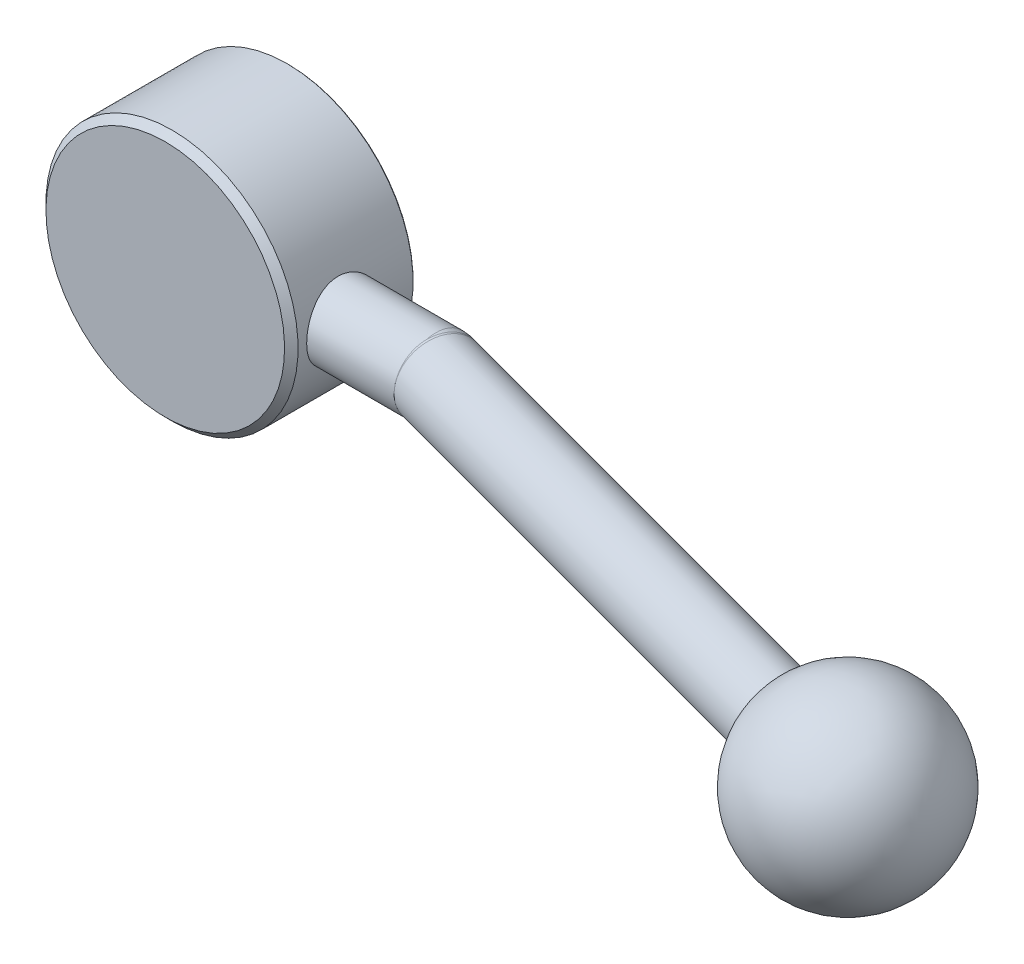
ISO-10303-21;
HEADER;
FILE_DESCRIPTION(('STEP AP214'),'2;1');
FILE_NAME('part.step','',(''),(''),'','','');
FILE_SCHEMA(('AUTOMOTIVE_DESIGN { 1 0 10303 214 1 1 1 1 }'));
ENDSEC;
DATA;
#1=APPLICATION_CONTEXT('core data for automotive mechanical design processes');
#2=APPLICATION_PROTOCOL_DEFINITION('international standard','automotive_design',2000,#1);
#3=PRODUCT_CONTEXT('',#1,'mechanical');
#4=PRODUCT('Part','Part','',(#3));
#5=PRODUCT_RELATED_PRODUCT_CATEGORY('part','',(#4));
#6=PRODUCT_DEFINITION_FORMATION('','',#4);
#7=PRODUCT_DEFINITION_CONTEXT('part definition',#1,'design');
#8=PRODUCT_DEFINITION('design','',#6,#7);
#9=PRODUCT_DEFINITION_SHAPE('','',#8);
#10=(LENGTH_UNIT() NAMED_UNIT(*) SI_UNIT(.MILLI.,.METRE.));
#11=(NAMED_UNIT(*) PLANE_ANGLE_UNIT() SI_UNIT($,.RADIAN.));
#12=(NAMED_UNIT(*) SI_UNIT($,.STERADIAN.) SOLID_ANGLE_UNIT());
#13=UNCERTAINTY_MEASURE_WITH_UNIT(LENGTH_MEASURE(1.E-05),#10,'distance_accuracy_value','');
#14=(GEOMETRIC_REPRESENTATION_CONTEXT(3) GLOBAL_UNCERTAINTY_ASSIGNED_CONTEXT((#13)) GLOBAL_UNIT_ASSIGNED_CONTEXT((#10,
#11,#12)) REPRESENTATION_CONTEXT('',''));
#15=CARTESIAN_POINT('',(0.,0.,0.));
#16=DIRECTION('',(0.,0.,1.));
#17=DIRECTION('',(1.,0.,0.));
#18=AXIS2_PLACEMENT_3D('',#15,#16,#17);
#19=CARTESIAN_POINT('',(0.,0.,0.));
#20=DIRECTION('',(0.,0.,-1.));
#21=DIRECTION('',(0.,1.,0.));
#22=AXIS2_PLACEMENT_3D('',#19,#20,#21);
#23=CYLINDRICAL_SURFACE('',#22,20.5);
#24=CARTESIAN_POINT('',(0.,0.,2.2));
#25=DIRECTION('',(0.,0.,-1.));
#26=DIRECTION('',(0.,1.,0.));
#27=AXIS2_PLACEMENT_3D('',#24,#25,#26);
#28=CIRCLE('',#27,20.5);
#29=CARTESIAN_POINT('',(0.,20.5,2.2));
#30=VERTEX_POINT('',#29);
#31=EDGE_CURVE('E97',#30,#30,#28,.T.);
#32=ORIENTED_EDGE('',*,*,#31,.F.);
#33=EDGE_LOOP('',(#32));
#34=FACE_BOUND('',#33,.T.);
#35=CARTESIAN_POINT('',(19.6022957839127,6.,13.5));
#36=CARTESIAN_POINT('',(19.602296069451,5.9999996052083,13.6645980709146));
#37=CARTESIAN_POINT('',(19.6043745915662,5.99322114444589,13.8292031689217));
#38=CARTESIAN_POINT('',(19.6126242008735,5.96616871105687,14.157201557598));
#39=CARTESIAN_POINT('',(19.618795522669,5.94589396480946,14.3205947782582));
#40=CARTESIAN_POINT('',(19.6350392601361,5.89203046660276,14.6449955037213));
#41=CARTESIAN_POINT('',(19.645112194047,5.85843994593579,14.8060026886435));
#42=CARTESIAN_POINT('',(19.6688547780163,5.77822628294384,15.124526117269));
#43=CARTESIAN_POINT('',(19.6825257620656,5.73159830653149,15.2820410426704));
#44=CARTESIAN_POINT('',(19.713022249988,5.62581323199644,15.592130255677));
#45=CARTESIAN_POINT('',(19.7298413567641,5.5666815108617,15.7447138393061));
#46=CARTESIAN_POINT('',(19.7661705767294,5.43627451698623,16.0443318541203));
#47=CARTESIAN_POINT('',(19.785681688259,5.36499473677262,16.1913642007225));
#48=CARTESIAN_POINT('',(19.8268343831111,5.2108537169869,16.4788588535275));
#49=CARTESIAN_POINT('',(19.8484753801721,5.12799566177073,16.6193229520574));
#50=CARTESIAN_POINT('',(19.8933081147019,4.95122279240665,16.8929236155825));
#51=CARTESIAN_POINT('',(19.9165004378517,4.85730379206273,17.0260573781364));
#52=CARTESIAN_POINT('',(19.9644466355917,4.65637414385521,17.2876250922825));
#53=CARTESIAN_POINT('',(19.9892257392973,4.54907914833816,17.4158360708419));
#54=CARTESIAN_POINT('',(20.039084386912,4.32416087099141,17.6628774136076));
#55=CARTESIAN_POINT('',(20.064164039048,4.20653376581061,17.7817042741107));
#56=CARTESIAN_POINT('',(20.1139266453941,3.9617603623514,18.0091415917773));
#57=CARTESIAN_POINT('',(20.1386096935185,3.83461635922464,18.117754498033));
#58=CARTESIAN_POINT('',(20.1869274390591,3.57153344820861,18.3241174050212));
#59=CARTESIAN_POINT('',(20.2105617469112,3.43559131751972,18.4218633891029));
#60=CARTESIAN_POINT('',(20.2565733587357,3.15310989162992,18.6075447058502));
#61=CARTESIAN_POINT('',(20.2789176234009,3.00641676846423,18.6952544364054));
#62=CARTESIAN_POINT('',(20.3212187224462,2.70575695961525,18.85799488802));
#63=CARTESIAN_POINT('',(20.3411746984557,2.5517876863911,18.9330210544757));
#64=CARTESIAN_POINT('',(20.3781129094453,2.23774430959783,19.0697232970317));
#65=CARTESIAN_POINT('',(20.3950961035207,2.07767219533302,19.1314036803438));
#66=CARTESIAN_POINT('',(20.42560313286,1.75253848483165,19.2409085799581));
#67=CARTESIAN_POINT('',(20.4391271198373,1.58747710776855,19.2887337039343));
#68=CARTESIAN_POINT('',(20.4620038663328,1.25813435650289,19.3689897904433));
#69=CARTESIAN_POINT('',(20.4714598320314,1.09395330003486,19.4018031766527));
#70=CARTESIAN_POINT('',(20.4864525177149,0.76330703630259,19.4535999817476));
#71=CARTESIAN_POINT('',(20.4919907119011,0.596842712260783,19.4725886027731));
#72=CARTESIAN_POINT('',(20.4989958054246,0.262822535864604,19.4965791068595));
#73=CARTESIAN_POINT('',(20.500462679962,0.095266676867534,19.5015809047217));
#74=CARTESIAN_POINT('',(20.4992830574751,-0.239660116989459,19.4975503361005));
#75=CARTESIAN_POINT('',(20.4966366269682,-0.407031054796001,19.4885181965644));
#76=CARTESIAN_POINT('',(20.4874491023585,-0.735222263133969,19.4569949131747));
#77=CARTESIAN_POINT('',(20.4810294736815,-0.896086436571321,19.4349234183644));
#78=CARTESIAN_POINT('',(20.4645655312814,-1.21537033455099,19.3778556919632));
#79=CARTESIAN_POINT('',(20.4545199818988,-1.37378920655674,19.3428550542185));
#80=CARTESIAN_POINT('',(20.4310714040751,-1.68699779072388,19.2602300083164));
#81=CARTESIAN_POINT('',(20.417669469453,-1.84178866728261,19.2126097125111));
#82=CARTESIAN_POINT('',(20.3878607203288,-2.14678325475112,19.1051327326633));
#83=CARTESIAN_POINT('',(20.3714527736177,-2.29698521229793,19.04527143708));
#84=CARTESIAN_POINT('',(20.3179422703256,-2.74243624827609,18.8465232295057));
#85=CARTESIAN_POINT('',(20.2768079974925,-3.02928804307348,18.6893299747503));
#86=CARTESIAN_POINT('',(20.1881245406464,-3.57292634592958,18.3311872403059));
#87=CARTESIAN_POINT('',(20.1405738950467,-3.8297059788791,18.1302277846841));
#88=CARTESIAN_POINT('',(20.0420851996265,-4.31608976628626,17.6814773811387));
#89=CARTESIAN_POINT('',(19.9910868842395,-4.5443478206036,17.432236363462));
#90=CARTESIAN_POINT('',(19.8929938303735,-4.95618403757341,16.8985135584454));
#91=CARTESIAN_POINT('',(19.8458994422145,-5.13975819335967,16.6140286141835));
#92=CARTESIAN_POINT('',(19.760667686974,-5.45834750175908,16.0144848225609));
#93=CARTESIAN_POINT('',(19.7226121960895,-5.59292425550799,15.6991805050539));
#94=CARTESIAN_POINT('',(19.6607470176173,-5.80668174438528,15.0490168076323));
#95=CARTESIAN_POINT('',(19.636932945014,-5.88587953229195,14.7141634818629));
#96=CARTESIAN_POINT('',(19.6072029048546,-5.98415852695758,14.0471839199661));
#97=CARTESIAN_POINT('',(19.6006798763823,-6.00527974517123,13.7153850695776));
#98=CARTESIAN_POINT('',(19.6045959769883,-5.9924844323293,13.052979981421));
#99=CARTESIAN_POINT('',(19.6150328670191,-5.95857516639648,12.7223735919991));
#100=CARTESIAN_POINT('',(19.6510985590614,-5.83849779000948,12.0800978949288));
#101=CARTESIAN_POINT('',(19.6763510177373,-5.75362308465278,11.7681634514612));
#102=CARTESIAN_POINT('',(19.7388196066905,-5.53550109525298,11.1629699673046));
#103=CARTESIAN_POINT('',(19.7760375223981,-5.40224659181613,10.8697137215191));
#104=CARTESIAN_POINT('',(19.859429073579,-5.08726254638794,10.3018842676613));
#105=CARTESIAN_POINT('',(19.9058087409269,-4.90437253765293,10.0279870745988));
#106=CARTESIAN_POINT('',(20.0018735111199,-4.49652620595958,9.51392317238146));
#107=CARTESIAN_POINT('',(20.0515593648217,-4.27156030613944,9.27376416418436));
#108=CARTESIAN_POINT('',(20.1254907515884,-3.90271430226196,8.93954124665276));
#109=CARTESIAN_POINT('',(20.1504641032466,-3.77196260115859,8.83082073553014));
#110=CARTESIAN_POINT('',(20.1992026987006,-3.5015777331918,8.62477718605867));
#111=CARTESIAN_POINT('',(20.2229683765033,-3.36194779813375,8.52745003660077));
#112=CARTESIAN_POINT('',(20.26863698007,-3.07465811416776,8.34485998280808));
#113=CARTESIAN_POINT('',(20.290539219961,-2.92699544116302,8.25960151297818));
#114=CARTESIAN_POINT('',(20.3318479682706,-2.62473033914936,8.10186753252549));
#115=CARTESIAN_POINT('',(20.351255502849,-2.47013079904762,8.0293867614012));
#116=CARTESIAN_POINT('',(20.3869012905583,-2.15616171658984,7.89824135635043));
#117=CARTESIAN_POINT('',(20.4031616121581,-1.99683515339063,7.839479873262));
#118=CARTESIAN_POINT('',(20.4322188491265,-1.67354665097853,7.73562199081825));
#119=CARTESIAN_POINT('',(20.4450171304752,-1.50958656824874,7.69052020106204));
#120=CARTESIAN_POINT('',(20.4667887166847,-1.17818990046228,7.61435869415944));
#121=CARTESIAN_POINT('',(20.4757621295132,-1.01075341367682,7.58329858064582));
#122=CARTESIAN_POINT('',(20.4896217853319,-0.67368142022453,7.53551127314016));
#123=CARTESIAN_POINT('',(20.4945081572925,-0.504045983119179,7.51878362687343));
#124=CARTESIAN_POINT('',(20.4999481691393,-0.170186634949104,7.50017093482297));
#125=CARTESIAN_POINT('',(20.5006551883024,-0.00599429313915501,7.49776044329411));
#126=CARTESIAN_POINT('',(20.4981265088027,0.322062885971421,7.50640275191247));
#127=CARTESIAN_POINT('',(20.4948894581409,0.485927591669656,7.5174601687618));
#128=CARTESIAN_POINT('',(20.4845610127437,0.812008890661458,7.55293963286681));
#129=CARTESIAN_POINT('',(20.4774712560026,0.974226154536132,7.57735600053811));
#130=CARTESIAN_POINT('',(20.4596287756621,1.29598110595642,7.63934399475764));
#131=CARTESIAN_POINT('',(20.4488746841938,1.45551776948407,7.67692053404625));
#132=CARTESIAN_POINT('',(20.424118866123,1.76913741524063,7.76446354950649));
#133=CARTESIAN_POINT('',(20.4101513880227,1.92325942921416,7.81429972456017));
#134=CARTESIAN_POINT('',(20.3792774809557,2.2267396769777,7.92614844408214));
#135=CARTESIAN_POINT('',(20.3623699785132,2.37609614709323,7.98816543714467));
#136=CARTESIAN_POINT('',(20.307879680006,2.81545866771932,8.19177825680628));
#137=CARTESIAN_POINT('',(20.2665061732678,3.09703370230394,8.3510134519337));
#138=CARTESIAN_POINT('',(20.1764364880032,3.63857835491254,8.71764071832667));
#139=CARTESIAN_POINT('',(20.127553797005,3.89761359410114,8.92636675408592));
#140=CARTESIAN_POINT('',(20.0533973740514,4.25750563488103,9.26901897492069));
#141=CARTESIAN_POINT('',(20.0285233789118,4.37275848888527,9.38825080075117));
#142=CARTESIAN_POINT('',(19.9791591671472,4.59302855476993,9.63586914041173));
#143=CARTESIAN_POINT('',(19.9546688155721,4.69804943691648,9.76425234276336));
#144=CARTESIAN_POINT('',(19.9060543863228,4.90001052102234,10.0331600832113));
#145=CARTESIAN_POINT('',(19.8819604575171,4.99663657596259,10.1739258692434));
#146=CARTESIAN_POINT('',(19.835595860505,5.17763097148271,10.4633483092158));
#147=CARTESIAN_POINT('',(19.8133245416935,5.2620036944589,10.6120021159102));
#148=CARTESIAN_POINT('',(19.771273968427,5.41786338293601,10.9162121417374));
#149=CARTESIAN_POINT('',(19.7514941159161,5.48935344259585,11.0717666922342));
#150=CARTESIAN_POINT('',(19.7150383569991,5.61887839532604,11.3887195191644));
#151=CARTESIAN_POINT('',(19.6983620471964,5.67691503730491,11.5501170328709));
#152=CARTESIAN_POINT('',(19.6704409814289,5.77286183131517,11.8578031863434));
#153=CARTESIAN_POINT('',(19.6587834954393,5.81235613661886,12.003562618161));
#154=CARTESIAN_POINT('',(19.6385752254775,5.88027391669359,12.2978447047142));
#155=CARTESIAN_POINT('',(19.6300241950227,5.90869826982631,12.4463671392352));
#156=CARTESIAN_POINT('',(19.6162509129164,5.95426469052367,12.7452883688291));
#157=CARTESIAN_POINT('',(19.6110286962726,5.97140663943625,12.8956871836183));
#158=CARTESIAN_POINT('',(19.6040514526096,5.99427298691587,13.1973888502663));
#159=CARTESIAN_POINT('',(19.6022955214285,6.00000036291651,13.3486914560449));
#160=CARTESIAN_POINT('',(19.6022957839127,6.,13.5));
#161=B_SPLINE_CURVE_WITH_KNOTS('',3,(#35,#36,#37,#38,#39,#40,#41,#42,#43,#44,#45,#46,#47,#48,
#49,#50,#51,#52,#53,#54,#55,#56,#57,#58,#59,#60,#61,#62,#63,#64,#65,#66,#67,#68,#69,#70,#71,#72,
#73,#74,#75,#76,#77,#78,#79,#80,#81,#82,#83,#84,#85,#86,#87,#88,#89,#90,#91,#92,#93,#94,#95,#96,
#97,#98,#99,#100,#101,#102,#103,#104,#105,#106,#107,#108,#109,#110,#111,#112,#113,#114,#115,
#116,#117,#118,#119,#120,#121,#122,#123,#124,#125,#126,#127,#128,#129,#130,#131,#132,#133,#134,
#135,#136,#137,#138,#139,#140,#141,#142,#143,#144,#145,#146,#147,#148,#149,#150,#151,#152,#153,
#154,#155,#156,#157,#158,#159,#160),.UNSPECIFIED.,.T.,.F.,(4,2,2,2,2,2,2,2,2,2,2,2,2,2,2,2,2,2,
2,2,2,2,2,2,2,2,2,2,2,2,2,2,2,2,2,2,2,2,2,2,2,2,2,2,2,2,2,2,2,2,2,2,2,2,2,2,2,2,2,2,2,2,4),(0.,
0.493654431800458,0.987337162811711,1.48108549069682,1.97501713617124,2.46795578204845,
2.96107772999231,3.45406432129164,3.9472380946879,4.45368702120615,4.96032415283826,
5.46683949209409,5.97354143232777,6.49001701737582,7.00667767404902,7.52317133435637,
8.03964233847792,8.5421022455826,9.04437298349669,9.54664678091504,10.0489124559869,
10.5358322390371,11.0229181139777,11.5098454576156,11.9969565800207,12.9811480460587,
13.9655640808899,14.9861703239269,16.0068680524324,17.0364860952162,18.06578694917,
19.058440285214,20.0509625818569,21.019302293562,21.9877865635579,22.9812230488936,
23.9748859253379,24.4899930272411,25.0049136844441,25.5200230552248,26.0349198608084,
26.5460638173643,27.0570058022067,27.5679333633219,28.0788448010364,28.5708836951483,
29.0630913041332,29.5550898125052,30.0472721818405,30.5344337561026,31.021773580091,
31.995601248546,32.9994682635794,33.5020562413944,34.004463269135,34.5211368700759,
35.0376252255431,35.5539893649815,36.0702863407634,36.5242331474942,36.9781439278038,
37.4320594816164,37.8858566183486),.UNSPECIFIED.);
#162=CARTESIAN_POINT('',(19.6022957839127,6.,13.5));
#163=VERTEX_POINT('',#162);
#164=EDGE_CURVE('E22',#163,#163,#161,.T.);
#165=ORIENTED_EDGE('',*,*,#164,.F.);
#166=EDGE_LOOP('',(#165));
#167=FACE_BOUND('',#166,.T.);
#168=CARTESIAN_POINT('',(0.,0.,20.9));
#169=DIRECTION('',(0.,0.,-1.));
#170=DIRECTION('',(0.,1.,0.));
#171=AXIS2_PLACEMENT_3D('',#168,#169,#170);
#172=CIRCLE('',#171,20.5);
#173=CARTESIAN_POINT('',(0.,20.5,20.9));
#174=VERTEX_POINT('',#173);
#175=EDGE_CURVE('E94',#174,#174,#172,.T.);
#176=ORIENTED_EDGE('',*,*,#175,.T.);
#177=EDGE_LOOP('',(#176));
#178=FACE_BOUND('',#177,.T.);
#179=ADVANCED_FACE('F14',(#34,#167,#178),#23,.T.);
#180=CARTESIAN_POINT('',(0.,0.,22.));
#181=DIRECTION('',(0.,0.,-1.));
#182=DIRECTION('',(0.,1.,0.));
#183=AXIS2_PLACEMENT_3D('',#180,#181,#182);
#184=PLANE('',#183);
#185=CARTESIAN_POINT('',(0.,0.,22.));
#186=DIRECTION('',(0.,0.,-1.));
#187=DIRECTION('',(0.,1.,0.));
#188=AXIS2_PLACEMENT_3D('',#185,#186,#187);
#189=CIRCLE('',#188,19.4);
#190=CARTESIAN_POINT('',(0.,19.4,22.));
#191=VERTEX_POINT('',#190);
#192=EDGE_CURVE('E91',#191,#191,#189,.T.);
#193=ORIENTED_EDGE('',*,*,#192,.F.);
#194=EDGE_LOOP('',(#193));
#195=FACE_BOUND('',#194,.T.);
#196=ADVANCED_FACE('F16',(#195),#184,.F.);
#197=CARTESIAN_POINT('',(0.,0.,22.));
#198=DIRECTION('',(0.,0.,-1.));
#199=DIRECTION('',(0.,1.,0.));
#200=AXIS2_PLACEMENT_3D('',#197,#198,#199);
#201=CONICAL_SURFACE('',#200,19.4,0.785398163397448);
#202=ORIENTED_EDGE('',*,*,#175,.F.);
#203=EDGE_LOOP('',(#202));
#204=FACE_BOUND('',#203,.T.);
#205=ORIENTED_EDGE('',*,*,#192,.T.);
#206=EDGE_LOOP('',(#205));
#207=FACE_BOUND('',#206,.T.);
#208=ADVANCED_FACE('F78',(#204,#207),#201,.T.);
#209=CARTESIAN_POINT('',(0.,0.,2.2));
#210=DIRECTION('',(0.,0.,1.));
#211=DIRECTION('',(0.,-1.,0.));
#212=AXIS2_PLACEMENT_3D('',#209,#210,#211);
#213=CONICAL_SURFACE('',#212,20.5,0.785398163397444);
#214=CARTESIAN_POINT('',(0.,0.,2.));
#215=DIRECTION('',(0.,0.,-1.));
#216=DIRECTION('',(0.,1.,0.));
#217=AXIS2_PLACEMENT_3D('',#214,#215,#216);
#218=CIRCLE('',#217,20.3);
#219=CARTESIAN_POINT('',(0.,20.3,2.));
#220=VERTEX_POINT('',#219);
#221=EDGE_CURVE('E100',#220,#220,#218,.T.);
#222=ORIENTED_EDGE('',*,*,#221,.F.);
#223=EDGE_LOOP('',(#222));
#224=FACE_BOUND('',#223,.T.);
#225=ORIENTED_EDGE('',*,*,#31,.T.);
#226=EDGE_LOOP('',(#225));
#227=FACE_BOUND('',#226,.T.);
#228=ADVANCED_FACE('F84',(#224,#227),#213,.T.);
#229=CARTESIAN_POINT('',(20.3,0.,2.));
#230=DIRECTION('',(0.,0.,1.));
#231=DIRECTION('',(0.,-1.,0.));
#232=AXIS2_PLACEMENT_3D('',#229,#230,#231);
#233=PLANE('',#232);
#234=CARTESIAN_POINT('',(0.,0.,2.));
#235=DIRECTION('',(0.,0.,-1.));
#236=DIRECTION('',(0.,1.,0.));
#237=AXIS2_PLACEMENT_3D('',#234,#235,#236);
#238=CIRCLE('',#237,9.5);
#239=CARTESIAN_POINT('',(0.,9.5,2.));
#240=VERTEX_POINT('',#239);
#241=EDGE_CURVE('E103',#240,#240,#238,.T.);
#242=ORIENTED_EDGE('',*,*,#241,.F.);
#243=EDGE_LOOP('',(#242));
#244=FACE_BOUND('',#243,.T.);
#245=ORIENTED_EDGE('',*,*,#221,.T.);
#246=EDGE_LOOP('',(#245));
#247=FACE_BOUND('',#246,.T.);
#248=ADVANCED_FACE('F112',(#244,#247),#233,.F.);
#249=CARTESIAN_POINT('',(0.,0.,0.));
#250=DIRECTION('',(0.,0.,-1.));
#251=DIRECTION('',(0.,1.,0.));
#252=AXIS2_PLACEMENT_3D('',#249,#250,#251);
#253=CYLINDRICAL_SURFACE('',#252,9.5);
#254=CARTESIAN_POINT('',(0.,0.,0.));
#255=DIRECTION('',(0.,0.,-1.));
#256=DIRECTION('',(0.,1.,0.));
#257=AXIS2_PLACEMENT_3D('',#254,#255,#256);
#258=CIRCLE('',#257,9.5);
#259=CARTESIAN_POINT('',(0.,9.5,0.));
#260=VERTEX_POINT('',#259);
#261=EDGE_CURVE('E38',#260,#260,#258,.T.);
#262=ORIENTED_EDGE('',*,*,#261,.F.);
#263=EDGE_LOOP('',(#262));
#264=FACE_BOUND('',#263,.T.);
#265=ORIENTED_EDGE('',*,*,#241,.T.);
#266=EDGE_LOOP('',(#265));
#267=FACE_BOUND('',#266,.T.);
#268=ADVANCED_FACE('F109',(#264,#267),#253,.T.);
#269=CARTESIAN_POINT('',(9.5,0.,0.));
#270=DIRECTION('',(0.,0.,1.));
#271=DIRECTION('',(0.,-1.,0.));
#272=AXIS2_PLACEMENT_3D('',#269,#270,#271);
#273=PLANE('',#272);
#274=CARTESIAN_POINT('',(0.,0.,0.));
#275=DIRECTION('',(0.,0.,-1.));
#276=DIRECTION('',(0.,1.,0.));
#277=AXIS2_PLACEMENT_3D('',#274,#275,#276);
#278=CIRCLE('',#277,5.);
#279=CARTESIAN_POINT('',(0.,5.,0.));
#280=VERTEX_POINT('',#279);
#281=EDGE_CURVE('E240',#280,#280,#278,.T.);
#282=ORIENTED_EDGE('',*,*,#281,.F.);
#283=EDGE_LOOP('',(#282));
#284=FACE_BOUND('',#283,.T.);
#285=ORIENTED_EDGE('',*,*,#261,.T.);
#286=EDGE_LOOP('',(#285));
#287=FACE_BOUND('',#286,.T.);
#288=ADVANCED_FACE('F71',(#284,#287),#273,.F.);
#289=CARTESIAN_POINT('',(41.5,0.,13.5));
#290=DIRECTION('',(1.,0.,0.));
#291=DIRECTION('',(0.,1.,0.));
#292=AXIS2_PLACEMENT_3D('',#289,#290,#291);
#293=CYLINDRICAL_SURFACE('',#292,6.);
#294=CARTESIAN_POINT('',(35.5002,-5.80289630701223,15.0252522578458));
#295=CARTESIAN_POINT('',(35.4582822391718,-5.76163633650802,15.1823953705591));
#296=CARTESIAN_POINT('',(35.4196657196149,-5.7137075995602,15.3386228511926));
#297=CARTESIAN_POINT('',(35.3477160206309,-5.6048321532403,15.6476859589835));
#298=CARTESIAN_POINT('',(35.3143816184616,-5.54388846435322,15.8005223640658));
#299=CARTESIAN_POINT('',(35.2516846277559,-5.40933866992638,16.1011931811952));
#300=CARTESIAN_POINT('',(35.2223187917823,-5.33574303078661,16.249031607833));
#301=CARTESIAN_POINT('',(35.1669003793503,-5.17630824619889,16.5386084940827));
#302=CARTESIAN_POINT('',(35.1408479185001,-5.09046867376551,16.6803467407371));
#303=CARTESIAN_POINT('',(35.0916157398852,-4.90713469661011,16.9565144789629));
#304=CARTESIAN_POINT('',(35.0684348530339,-4.80964506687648,17.0909469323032));
#305=CARTESIAN_POINT('',(35.0246338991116,-4.60359121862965,17.3515649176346));
#306=CARTESIAN_POINT('',(35.0040147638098,-4.49502299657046,17.4777474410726));
#307=CARTESIAN_POINT('',(34.9651498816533,-4.26763611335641,17.7207771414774));
#308=CARTESIAN_POINT('',(34.9469028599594,-4.14882301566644,17.8376293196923));
#309=CARTESIAN_POINT('',(34.9126153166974,-3.90166417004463,18.0612276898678));
#310=CARTESIAN_POINT('',(34.8965756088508,-3.77331493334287,18.1679701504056));
#311=CARTESIAN_POINT('',(34.8665183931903,-3.50726425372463,18.3710637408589));
#312=CARTESIAN_POINT('',(34.8525127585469,-3.36951429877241,18.4673530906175));
#313=CARTESIAN_POINT('',(34.8265462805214,-3.08623101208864,18.6481475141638));
#314=CARTESIAN_POINT('',(34.8145862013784,-2.94069479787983,18.7326481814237));
#315=CARTESIAN_POINT('',(34.7926597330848,-2.64294989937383,18.8891648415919));
#316=CARTESIAN_POINT('',(34.7826929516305,-2.49074253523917,18.9611832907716));
#317=CARTESIAN_POINT('',(34.7647029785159,-2.18065815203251,19.092233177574));
#318=CARTESIAN_POINT('',(34.7566805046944,-2.02277906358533,19.1512598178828));
#319=CARTESIAN_POINT('',(34.7425870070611,-1.70332850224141,19.2555856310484));
#320=CARTESIAN_POINT('',(34.7365065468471,-1.54177910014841,19.3009511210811));
#321=CARTESIAN_POINT('',(34.7262194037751,-1.21533071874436,19.378019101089));
#322=CARTESIAN_POINT('',(34.7220134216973,-1.05043051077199,19.4097164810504));
#323=CARTESIAN_POINT('',(34.7154660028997,-0.71860500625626,19.4591719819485));
#324=CARTESIAN_POINT('',(34.7131235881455,-0.551680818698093,19.4769374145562));
#325=CARTESIAN_POINT('',(34.710291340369,-0.216839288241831,19.4984280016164));
#326=CARTESIAN_POINT('',(34.7098023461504,-0.0489215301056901,19.5021467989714));
#327=CARTESIAN_POINT('',(34.7106764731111,0.286163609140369,19.4955078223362));
#328=CARTESIAN_POINT('',(34.7120344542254,0.453331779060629,19.4851891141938));
#329=CARTESIAN_POINT('',(34.7165967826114,0.78612042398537,19.4506291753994));
#330=CARTESIAN_POINT('',(34.7198002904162,0.951741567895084,19.4263942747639));
#331=CARTESIAN_POINT('',(34.7280656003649,1.28041642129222,19.3641727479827));
#332=CARTESIAN_POINT('',(34.7331283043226,1.44346884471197,19.3261794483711));
#333=CARTESIAN_POINT('',(34.7451271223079,1.76570625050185,19.2367438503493));
#334=CARTESIAN_POINT('',(34.7520625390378,1.92489264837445,19.1853065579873));
#335=CARTESIAN_POINT('',(34.7678369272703,2.23840371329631,19.0693353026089));
#336=CARTESIAN_POINT('',(34.7766767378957,2.39272620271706,19.0047955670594));
#337=CARTESIAN_POINT('',(34.7962906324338,2.69529094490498,18.863142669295));
#338=CARTESIAN_POINT('',(34.8070640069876,2.84353540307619,18.7860341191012));
#339=CARTESIAN_POINT('',(34.8305995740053,3.13300119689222,18.6197820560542));
#340=CARTESIAN_POINT('',(34.8433622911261,3.27422066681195,18.5306353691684));
#341=CARTESIAN_POINT('',(34.8709361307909,3.54855763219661,18.3410259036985));
#342=CARTESIAN_POINT('',(34.8857465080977,3.68167805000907,18.2405672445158));
#343=CARTESIAN_POINT('',(34.9175622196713,3.93937834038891,18.0287099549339));
#344=CARTESIAN_POINT('',(34.9345746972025,4.06392830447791,17.9172760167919));
#345=CARTESIAN_POINT('',(34.9708735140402,4.30309404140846,17.6846387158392));
#346=CARTESIAN_POINT('',(34.990159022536,4.41771341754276,17.5634389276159));
#347=CARTESIAN_POINT('',(35.0311875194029,4.6363260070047,17.3121162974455));
#348=CARTESIAN_POINT('',(35.0529314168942,4.74031526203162,17.1819901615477));
#349=CARTESIAN_POINT('',(35.0991047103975,4.93688268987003,16.9139128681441));
#350=CARTESIAN_POINT('',(35.1235330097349,5.02946549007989,16.775964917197));
#351=CARTESIAN_POINT('',(35.1725720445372,5.19312021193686,16.5088639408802));
#352=CARTESIAN_POINT('',(35.1968667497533,5.26543815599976,16.3804141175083));
#353=CARTESIAN_POINT('',(35.2482373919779,5.40022788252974,16.1190011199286));
#354=CARTESIAN_POINT('',(35.2753129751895,5.46270091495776,15.9860385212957));
#355=CARTESIAN_POINT('',(35.3327563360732,5.57750379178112,15.7165012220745));
#356=CARTESIAN_POINT('',(35.3631238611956,5.62983441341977,15.5799267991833));
#357=CARTESIAN_POINT('',(35.4281734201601,5.72416883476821,15.3042217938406));
#358=CARTESIAN_POINT('',(35.4628566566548,5.76616974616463,15.1650905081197));
#359=CARTESIAN_POINT('',(35.5001999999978,5.80289630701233,15.0252522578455));
#360=B_SPLINE_CURVE_WITH_KNOTS('',3,(#294,#295,#296,#297,#298,#299,#300,#301,#302,#303,#304,
#305,#306,#307,#308,#309,#310,#311,#312,#313,#314,#315,#316,#317,#318,#319,#320,#321,#322,#323,
#324,#325,#326,#327,#328,#329,#330,#331,#332,#333,#334,#335,#336,#337,#338,#339,#340,#341,#342,
#343,#344,#345,#346,#347,#348,#349,#350,#351,#352,#353,#354,#355,#356,#357,#358,#359),
.UNSPECIFIED.,.F.,.F.,(4,2,2,2,2,2,2,2,2,2,2,2,2,2,2,2,2,2,2,2,2,2,2,2,2,2,2,2,2,2,2,2,4),(0.,
0.503145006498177,1.00617337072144,1.50878758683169,2.01141933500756,2.51384577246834,
3.01645442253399,3.5187918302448,4.0213139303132,4.52666061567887,5.03219569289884,
5.53763117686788,6.04325298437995,6.5463791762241,7.04969330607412,7.55274311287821,
8.05602055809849,8.55790026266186,9.05955185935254,9.56144710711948,10.0631557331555,
10.5650858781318,11.0668322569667,11.5687111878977,12.0704079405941,12.5737749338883,
13.0769585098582,13.580328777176,14.0834941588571,14.5312769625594,14.9790028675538,
15.4266944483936,15.8745110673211),.UNSPECIFIED.);
#361=CARTESIAN_POINT('',(35.5,-5.80270009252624,15.0259985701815));
#362=VERTEX_POINT('',#361);
#363=CARTESIAN_POINT('',(34.7100850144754,0.,19.5));
#364=VERTEX_POINT('',#363);
#365=EDGE_CURVE('E29',#362,#364,#360,.T.);
#366=ORIENTED_EDGE('',*,*,#365,.T.);
#367=CARTESIAN_POINT('',(35.5,5.80270009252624,15.0259985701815));
#368=VERTEX_POINT('',#367);
#369=EDGE_CURVE('E40',#364,#368,#360,.T.);
#370=ORIENTED_EDGE('',*,*,#369,.T.);
#371=CARTESIAN_POINT('',(35.5,0.,13.5));
#372=DIRECTION('',(1.,0.,0.));
#373=DIRECTION('',(0.,1.,0.));
#374=AXIS2_PLACEMENT_3D('',#371,#372,#373);
#375=CIRCLE('',#374,6.);
#376=EDGE_CURVE('E36',#362,#368,#375,.T.);
#377=ORIENTED_EDGE('',*,*,#376,.F.);
#378=EDGE_LOOP('',(#366,#370,#377));
#379=FACE_BOUND('',#378,.T.);
#380=ORIENTED_EDGE('',*,*,#164,.T.);
#381=EDGE_LOOP('',(#380));
#382=FACE_BOUND('',#381,.T.);
#383=ADVANCED_FACE('F41',(#379,#382),#293,.T.);
#384=CARTESIAN_POINT('',(35.5,0.,13.5));
#385=DIRECTION('',(1.,0.,0.));
#386=DIRECTION('',(0.,0.,-1.));
#387=AXIS2_PLACEMENT_3D('',#384,#385,#386);
#388=SPHERICAL_SURFACE('',#387,6.);
#389=CARTESIAN_POINT('',(35.8814996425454,0.,13.6022225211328));
#390=DIRECTION('',(0.965925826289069,0.,0.258819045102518));
#391=DIRECTION('',(-0.258819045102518,0.,0.965925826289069));
#392=AXIS2_PLACEMENT_3D('',#389,#390,#391);
#393=CIRCLE('',#392,5.98698660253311);
#394=EDGE_CURVE('E9',#362,#368,#393,.T.);
#395=ORIENTED_EDGE('',*,*,#394,.F.);
#396=ORIENTED_EDGE('',*,*,#376,.T.);
#397=EDGE_LOOP('',(#395,#396));
#398=FACE_BOUND('',#397,.T.);
#399=ADVANCED_FACE('F37',(#398),#388,.T.);
#400=CARTESIAN_POINT('',(36.2629992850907,0.,13.7044450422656));
#401=DIRECTION('',(0.965925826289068,0.,0.258819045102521));
#402=DIRECTION('',(-0.258819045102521,0.,0.965925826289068));
#403=AXIS2_PLACEMENT_3D('',#400,#401,#402);
#404=SPHERICAL_SURFACE('',#403,6.);
#405=ORIENTED_EDGE('',*,*,#365,.F.);
#406=ORIENTED_EDGE('',*,*,#394,.T.);
#407=ORIENTED_EDGE('',*,*,#369,.F.);
#408=CARTESIAN_POINT('',(36.2629992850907,0.,13.7044450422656));
#409=DIRECTION('',(0.965925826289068,0.,0.258819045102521));
#410=DIRECTION('',(-0.258819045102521,0.,0.965925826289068));
#411=AXIS2_PLACEMENT_3D('',#408,#409,#410);
#412=CIRCLE('',#411,6.);
#413=EDGE_CURVE('E45',#364,#364,#412,.T.);
#414=ORIENTED_EDGE('',*,*,#413,.F.);
#415=EDGE_LOOP('',(#405,#406,#407,#414));
#416=FACE_BOUND('',#415,.T.);
#417=ADVANCED_FACE('F47',(#416),#404,.T.);
#418=CARTESIAN_POINT('',(141.483133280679,0.,41.8980949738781));
#419=DIRECTION('',(0.965925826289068,0.,0.258819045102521));
#420=DIRECTION('',(-0.258819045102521,0.,0.965925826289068));
#421=AXIS2_PLACEMENT_3D('',#418,#419,#420);
#422=CYLINDRICAL_SURFACE('',#421,6.);
#423=CARTESIAN_POINT('',(114.851814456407,0.,34.7622546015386));
#424=DIRECTION('',(0.965925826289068,0.,0.258819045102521));
#425=DIRECTION('',(-0.258819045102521,0.,0.965925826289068));
#426=AXIS2_PLACEMENT_3D('',#423,#424,#425);
#427=CIRCLE('',#426,6.);
#428=CARTESIAN_POINT('',(116.404728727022,0.,28.9666996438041));
#429=VERTEX_POINT('',#428);
#430=EDGE_CURVE('E243',#429,#429,#427,.T.);
#431=ORIENTED_EDGE('',*,*,#430,.F.);
#432=EDGE_LOOP('',(#431));
#433=FACE_BOUND('',#432,.T.);
#434=ORIENTED_EDGE('',*,*,#413,.T.);
#435=EDGE_LOOP('',(#434));
#436=FACE_BOUND('',#435,.T.);
#437=ADVANCED_FACE('F64',(#433,#436),#422,.T.);
#438=CARTESIAN_POINT('',(114.851814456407,0.,34.7622546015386));
#439=DIRECTION('',(-0.965925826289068,0.,-0.258819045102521));
#440=DIRECTION('',(0.258819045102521,0.,-0.965925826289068));
#441=AXIS2_PLACEMENT_3D('',#438,#439,#440);
#442=CONICAL_SURFACE('',#441,6.,1.48352986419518);
#443=CARTESIAN_POINT('',(114.68956979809,0.,34.7187812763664));
#444=DIRECTION('',(0.965925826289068,0.,0.258819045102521));
#445=DIRECTION('',(-0.258819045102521,0.,0.965925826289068));
#446=AXIS2_PLACEMENT_3D('',#443,#444,#445);
#447=CIRCLE('',#446,7.91988336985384);
#448=CARTESIAN_POINT('',(116.739386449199,0.,27.0687613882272));
#449=VERTEX_POINT('',#448);
#450=EDGE_CURVE('E239',#449,#449,#447,.T.);
#451=CARTESIAN_POINT('',(116.739386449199,0.,27.0687613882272));
#452=CARTESIAN_POINT('',(116.73590043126,0.,27.0885315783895));
#453=CARTESIAN_POINT('',(116.732414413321,0.,27.1083017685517));
#454=CARTESIAN_POINT('',(116.725442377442,0.,27.1478421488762));
#455=CARTESIAN_POINT('',(116.721956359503,0.,27.1676123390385));
#456=CARTESIAN_POINT('',(116.714984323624,0.,27.207152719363));
#457=CARTESIAN_POINT('',(116.711498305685,0.,27.2269229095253));
#458=CARTESIAN_POINT('',(116.704526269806,0.,27.2664632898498));
#459=CARTESIAN_POINT('',(116.701040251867,0.,27.286233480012));
#460=CARTESIAN_POINT('',(116.694068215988,0.,27.3257738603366));
#461=CARTESIAN_POINT('',(116.690582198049,0.,27.3455440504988));
#462=CARTESIAN_POINT('',(116.68361016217,0.,27.3850844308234));
#463=CARTESIAN_POINT('',(116.68012414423,0.,27.4048546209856));
#464=CARTESIAN_POINT('',(116.673152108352,0.,27.4443950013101));
#465=CARTESIAN_POINT('',(116.669666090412,0.,27.4641651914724));
#466=CARTESIAN_POINT('',(116.662694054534,0.,27.5037055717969));
#467=CARTESIAN_POINT('',(116.659208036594,0.,27.5234757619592));
#468=CARTESIAN_POINT('',(116.652236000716,0.,27.5630161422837));
#469=CARTESIAN_POINT('',(116.648749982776,0.,27.5827863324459));
#470=CARTESIAN_POINT('',(116.641777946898,0.,27.6223267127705));
#471=CARTESIAN_POINT('',(116.638291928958,0.,27.6420969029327));
#472=CARTESIAN_POINT('',(116.63131989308,0.,27.6816372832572));
#473=CARTESIAN_POINT('',(116.62783387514,0.,27.7014074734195));
#474=CARTESIAN_POINT('',(116.620861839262,0.,27.740947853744));
#475=CARTESIAN_POINT('',(116.617375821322,0.,27.7607180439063));
#476=CARTESIAN_POINT('',(116.610403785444,0.,27.8002584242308));
#477=CARTESIAN_POINT('',(116.606917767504,0.,27.8200286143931));
#478=CARTESIAN_POINT('',(116.599945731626,0.,27.8595689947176));
#479=CARTESIAN_POINT('',(116.596459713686,0.,27.8793391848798));
#480=CARTESIAN_POINT('',(116.589487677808,0.,27.9188795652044));
#481=CARTESIAN_POINT('',(116.586001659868,0.,27.9386497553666));
#482=CARTESIAN_POINT('',(116.57902962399,0.,27.9781901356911));
#483=CARTESIAN_POINT('',(116.57554360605,0.,27.9979603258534));
#484=CARTESIAN_POINT('',(116.568571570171,0.,28.0375007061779));
#485=CARTESIAN_POINT('',(116.565085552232,0.,28.0572708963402));
#486=CARTESIAN_POINT('',(116.558113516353,0.,28.0968112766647));
#487=CARTESIAN_POINT('',(116.554627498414,0.,28.116581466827));
#488=CARTESIAN_POINT('',(116.547655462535,0.,28.1561218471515));
#489=CARTESIAN_POINT('',(116.544169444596,0.,28.1758920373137));
#490=CARTESIAN_POINT('',(116.537197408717,0.,28.2154324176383));
#491=CARTESIAN_POINT('',(116.533711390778,0.,28.2352026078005));
#492=CARTESIAN_POINT('',(116.526739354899,0.,28.274742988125));
#493=CARTESIAN_POINT('',(116.52325333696,0.,28.2945131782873));
#494=CARTESIAN_POINT('',(116.516281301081,0.,28.3340535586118));
#495=CARTESIAN_POINT('',(116.512795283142,0.,28.3538237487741));
#496=CARTESIAN_POINT('',(116.505823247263,0.,28.3933641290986));
#497=CARTESIAN_POINT('',(116.502337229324,0.,28.4131343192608));
#498=CARTESIAN_POINT('',(116.495365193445,0.,28.4526746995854));
#499=CARTESIAN_POINT('',(116.491879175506,0.,28.4724448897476));
#500=CARTESIAN_POINT('',(116.484907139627,0.,28.5119852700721));
#501=CARTESIAN_POINT('',(116.481421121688,0.,28.5317554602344));
#502=CARTESIAN_POINT('',(116.474449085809,0.,28.5712958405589));
#503=CARTESIAN_POINT('',(116.47096306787,0.,28.5910660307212));
#504=CARTESIAN_POINT('',(116.463991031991,0.,28.6306064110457));
#505=CARTESIAN_POINT('',(116.460505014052,0.,28.650376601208));
#506=CARTESIAN_POINT('',(116.453532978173,0.,28.6899169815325));
#507=CARTESIAN_POINT('',(116.450046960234,0.,28.7096871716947));
#508=CARTESIAN_POINT('',(116.443074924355,0.,28.7492275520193));
#509=CARTESIAN_POINT('',(116.439588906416,0.,28.7689977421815));
#510=CARTESIAN_POINT('',(116.432616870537,0.,28.808538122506));
#511=CARTESIAN_POINT('',(116.429130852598,0.,28.8283083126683));
#512=CARTESIAN_POINT('',(116.422158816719,0.,28.8678486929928));
#513=CARTESIAN_POINT('',(116.41867279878,0.,28.8876188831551));
#514=CARTESIAN_POINT('',(116.411700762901,0.,28.9271592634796));
#515=CARTESIAN_POINT('',(116.408214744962,0.,28.9469294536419));
#516=CARTESIAN_POINT('',(116.404728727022,0.,28.9666996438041));
#517=B_SPLINE_CURVE_WITH_KNOTS('',3,(#451,#452,#453,#454,#455,#456,#457,#458,#459,#460,#461,
#462,#463,#464,#465,#466,#467,#468,#469,#470,#471,#472,#473,#474,#475,#476,#477,#478,#479,#480,
#481,#482,#483,#484,#485,#486,#487,#488,#489,#490,#491,#492,#493,#494,#495,#496,#497,#498,#499,
#500,#501,#502,#503,#504,#505,#506,#507,#508,#509,#510,#511,#512,#513,#514,#515,#516),
.UNSPECIFIED.,.F.,.F.,(4,2,2,2,2,2,2,2,2,2,2,2,2,2,2,2,2,2,2,2,2,2,2,2,2,2,2,2,2,2,2,2,4),(0.,
0.0602255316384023,0.120451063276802,0.180676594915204,0.240902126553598,0.301127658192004,
0.361353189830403,0.421578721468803,0.481804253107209,0.542029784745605,0.602255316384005,
0.662480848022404,0.722706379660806,0.782931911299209,0.843157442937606,0.903382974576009,
0.963608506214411,1.02383403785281,1.08405956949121,1.14428510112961,1.20451063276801,
1.26473616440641,1.32496169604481,1.38518722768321,1.44541275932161,1.50563829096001,
1.56586382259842,1.62608935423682,1.68631488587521,1.74654041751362,1.80676594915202,
1.86699148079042,1.92721701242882),.UNSPECIFIED.);
#518=EDGE_CURVE('BSEAM195',#449,#429,#517,.T.);
#519=ORIENTED_EDGE('',*,*,#450,.F.);
#520=ORIENTED_EDGE('',*,*,#430,.T.);
#521=ORIENTED_EDGE('',*,*,#518,.T.);
#522=ORIENTED_EDGE('',*,*,#518,.F.);
#523=EDGE_LOOP('',(#519,#521,#520,#522));
#524=FACE_BOUND('',#523,.T.);
#525=ADVANCED_FACE('F195',(#524),#442,.F.);
#526=CARTESIAN_POINT('',(126.994245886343,0.,38.0158092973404));
#527=DIRECTION('',(0.965925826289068,0.,0.258819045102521));
#528=DIRECTION('',(0.258819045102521,0.,-0.965925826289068));
#529=AXIS2_PLACEMENT_3D('',#526,#527,#528);
#530=SPHERICAL_SURFACE('',#529,15.);
#531=ORIENTED_EDGE('',*,*,#450,.T.);
#532=EDGE_LOOP('',(#531));
#533=FACE_BOUND('',#532,.T.);
#534=ADVANCED_FACE('F203',(#533),#530,.T.);
#535=CARTESIAN_POINT('',(0.,0.,21.));
#536=DIRECTION('',(0.,0.,-1.));
#537=DIRECTION('',(0.,1.,0.));
#538=AXIS2_PLACEMENT_3D('',#535,#536,#537);
#539=CYLINDRICAL_SURFACE('',#538,5.);
#540=CARTESIAN_POINT('',(0.,0.,21.));
#541=DIRECTION('',(0.,0.,-1.));
#542=DIRECTION('',(0.,1.,0.));
#543=AXIS2_PLACEMENT_3D('',#540,#541,#542);
#544=CIRCLE('',#543,5.);
#545=CARTESIAN_POINT('',(0.,5.,21.));
#546=VERTEX_POINT('',#545);
#547=EDGE_CURVE('E238',#546,#546,#544,.T.);
#548=ORIENTED_EDGE('',*,*,#547,.F.);
#549=EDGE_LOOP('',(#548));
#550=FACE_BOUND('',#549,.T.);
#551=ORIENTED_EDGE('',*,*,#281,.T.);
#552=EDGE_LOOP('',(#551));
#553=FACE_BOUND('',#552,.T.);
#554=ADVANCED_FACE('F211',(#550,#553),#539,.F.);
#555=CARTESIAN_POINT('',(0.,0.,21.));
#556=DIRECTION('',(0.,0.,-1.));
#557=DIRECTION('',(0.,1.,0.));
#558=AXIS2_PLACEMENT_3D('',#555,#556,#557);
#559=PLANE('',#558);
#560=ORIENTED_EDGE('',*,*,#547,.T.);
#561=EDGE_LOOP('',(#560));
#562=FACE_BOUND('',#561,.T.);
#563=ADVANCED_FACE('F220',(#562),#559,.T.);
#564=CLOSED_SHELL('',(#179,#196,#208,#228,#248,#268,#288,#383,#399,#417,#437,#525,#534,#554,#563));
#565=MANIFOLD_SOLID_BREP('B1',#564);
#566=ADVANCED_BREP_SHAPE_REPRESENTATION('',(#18,#565),#14);
#567=SHAPE_DEFINITION_REPRESENTATION(#9,#566);
ENDSEC;
END-ISO-10303-21;
